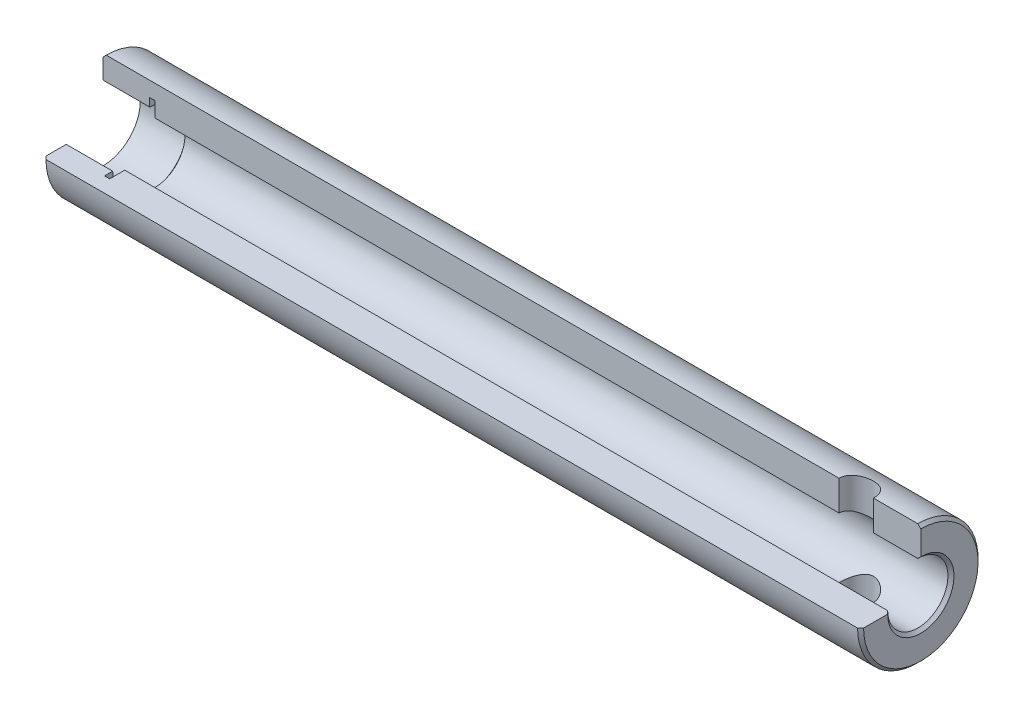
ISO-10303-21;
HEADER;
FILE_DESCRIPTION(('STEP AP214'),'2;1');
FILE_NAME('part.step','',(''),(''),'','','');
FILE_SCHEMA(('AUTOMOTIVE_DESIGN { 1 0 10303 214 1 1 1 1 }'));
ENDSEC;
DATA;
#1=APPLICATION_CONTEXT('core data for automotive mechanical design processes');
#2=APPLICATION_PROTOCOL_DEFINITION('international standard','automotive_design',2000,#1);
#3=PRODUCT_CONTEXT('',#1,'mechanical');
#4=PRODUCT('Part','Part','',(#3));
#5=PRODUCT_RELATED_PRODUCT_CATEGORY('part','',(#4));
#6=PRODUCT_DEFINITION_FORMATION('','',#4);
#7=PRODUCT_DEFINITION_CONTEXT('part definition',#1,'design');
#8=PRODUCT_DEFINITION('design','',#6,#7);
#9=PRODUCT_DEFINITION_SHAPE('','',#8);
#10=(LENGTH_UNIT() NAMED_UNIT(*) SI_UNIT(.MILLI.,.METRE.));
#11=(NAMED_UNIT(*) PLANE_ANGLE_UNIT() SI_UNIT($,.RADIAN.));
#12=(NAMED_UNIT(*) SI_UNIT($,.STERADIAN.) SOLID_ANGLE_UNIT());
#13=UNCERTAINTY_MEASURE_WITH_UNIT(LENGTH_MEASURE(1.E-05),#10,'distance_accuracy_value','');
#14=(GEOMETRIC_REPRESENTATION_CONTEXT(3) GLOBAL_UNCERTAINTY_ASSIGNED_CONTEXT((#13)) GLOBAL_UNIT_ASSIGNED_CONTEXT((#10,
#11,#12)) REPRESENTATION_CONTEXT('',''));
#15=CARTESIAN_POINT('',(0.,0.,0.));
#16=DIRECTION('',(0.,0.,1.));
#17=DIRECTION('',(1.,0.,0.));
#18=AXIS2_PLACEMENT_3D('',#15,#16,#17);
#19=CARTESIAN_POINT('',(95.,0.,0.));
#20=DIRECTION('',(-1.,0.,0.));
#21=DIRECTION('',(0.,0.,1.));
#22=AXIS2_PLACEMENT_3D('',#19,#20,#21);
#23=CYLINDRICAL_SURFACE('',#22,3.5);
#24=CARTESIAN_POINT('',(87.5,-2.87228132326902,2.));
#25=CARTESIAN_POINT('',(87.3982407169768,-2.87228454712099,1.99999795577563));
#26=CARTESIAN_POINT('',(87.296466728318,-2.87777067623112,1.99218519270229));
#27=CARTESIAN_POINT('',(87.0962654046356,-2.89880046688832,1.96144931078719));
#28=CARTESIAN_POINT('',(86.9978417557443,-2.91435485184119,1.938510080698));
#29=CARTESIAN_POINT('',(86.8076214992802,-2.95309076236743,1.87896057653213));
#30=CARTESIAN_POINT('',(86.7157863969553,-2.97622267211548,1.84243903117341));
#31=CARTESIAN_POINT('',(86.5395840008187,-3.02742059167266,1.75704253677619));
#32=CARTESIAN_POINT('',(86.4552191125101,-3.05548818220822,1.7081636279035));
#33=CARTESIAN_POINT('',(86.2861806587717,-3.11712928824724,1.59317521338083));
#34=CARTESIAN_POINT('',(86.2024899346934,-3.15096898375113,1.5257632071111));
#35=CARTESIAN_POINT('',(86.0468020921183,-3.21820634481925,1.37830388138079));
#36=CARTESIAN_POINT('',(85.9748125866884,-3.25160370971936,1.2982484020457));
#37=CARTESIAN_POINT('',(85.8378329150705,-3.31796239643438,1.11854160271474));
#38=CARTESIAN_POINT('',(85.7741545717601,-3.35058180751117,1.01775177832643));
#39=CARTESIAN_POINT('',(85.6651191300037,-3.40802542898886,0.804671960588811));
#40=CARTESIAN_POINT('',(85.619746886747,-3.43285607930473,0.692391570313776));
#41=CARTESIAN_POINT('',(85.5528618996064,-3.46996336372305,0.470016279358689));
#42=CARTESIAN_POINT('',(85.5295943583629,-3.48315582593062,0.360605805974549));
#43=CARTESIAN_POINT('',(85.5016929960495,-3.49901289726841,0.138713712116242));
#44=CARTESIAN_POINT('',(85.4970437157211,-3.50168624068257,0.0262347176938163));
#45=CARTESIAN_POINT('',(85.50608689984,-3.49652510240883,-0.18494696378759));
#46=CARTESIAN_POINT('',(85.5177697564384,-3.48984178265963,-0.283772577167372));
#47=CARTESIAN_POINT('',(85.5553945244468,-3.4686091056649,-0.477779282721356));
#48=CARTESIAN_POINT('',(85.5813374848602,-3.45405916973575,-0.572960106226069));
#49=CARTESIAN_POINT('',(85.6466509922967,-3.41820908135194,-0.758178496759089));
#50=CARTESIAN_POINT('',(85.6861387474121,-3.39685012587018,-0.848162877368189));
#51=CARTESIAN_POINT('',(85.7771178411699,-3.34915268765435,-1.02037827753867));
#52=CARTESIAN_POINT('',(85.8286127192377,-3.3228127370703,-1.10260700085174));
#53=CARTESIAN_POINT('',(85.9487459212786,-3.26394555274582,-1.26692918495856));
#54=CARTESIAN_POINT('',(86.0186641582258,-3.23105548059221,-1.34795656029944));
#55=CARTESIAN_POINT('',(86.1703346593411,-3.16439037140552,-1.49778980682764));
#56=CARTESIAN_POINT('',(86.2521012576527,-3.1306143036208,-1.56658064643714));
#57=CARTESIAN_POINT('',(86.4348802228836,-3.06212243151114,-1.69686219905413));
#58=CARTESIAN_POINT('',(86.5369984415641,-3.02764831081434,-1.75694261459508));
#59=CARTESIAN_POINT('',(86.7520775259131,-2.96628701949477,-1.85868169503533));
#60=CARTESIAN_POINT('',(86.8650187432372,-2.93938643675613,-1.90037300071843));
#61=CARTESIAN_POINT('',(87.0719095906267,-2.90265362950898,-1.955874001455));
#62=CARTESIAN_POINT('',(87.1642913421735,-2.89032428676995,-1.97388069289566));
#63=CARTESIAN_POINT('',(87.3513881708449,-2.87461858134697,-1.99669026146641));
#64=CARTESIAN_POINT('',(87.4461009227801,-2.87123363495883,-2.00150579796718));
#65=CARTESIAN_POINT('',(87.6351634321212,-2.87390377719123,-1.99766863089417));
#66=CARTESIAN_POINT('',(87.7295129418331,-2.87996444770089,-1.98900796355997));
#67=CARTESIAN_POINT('',(87.9151495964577,-2.90065746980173,-1.95870152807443));
#68=CARTESIAN_POINT('',(88.0064344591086,-2.91529606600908,-1.93704629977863));
#69=CARTESIAN_POINT('',(88.1849532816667,-2.95150911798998,-1.88140846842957));
#70=CARTESIAN_POINT('',(88.2721221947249,-2.97316813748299,-1.84727488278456));
#71=CARTESIAN_POINT('',(88.4398419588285,-3.02106419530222,-1.76785702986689));
#72=CARTESIAN_POINT('',(88.5203900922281,-3.04730309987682,-1.72256821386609));
#73=CARTESIAN_POINT('',(88.6867473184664,-3.10666399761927,-1.61341400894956));
#74=CARTESIAN_POINT('',(88.77120471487,-3.14020508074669,-1.54771199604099));
#75=CARTESIAN_POINT('',(88.9286857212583,-3.20718874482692,-1.40365915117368));
#76=CARTESIAN_POINT('',(89.0016997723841,-3.2406312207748,-1.32529785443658));
#77=CARTESIAN_POINT('',(89.1414787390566,-3.30761562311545,-1.14867494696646));
#78=CARTESIAN_POINT('',(89.2068912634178,-3.34083391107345,-1.04920745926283));
#79=CARTESIAN_POINT('',(89.3196584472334,-3.39983021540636,-0.838502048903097));
#80=CARTESIAN_POINT('',(89.3670273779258,-3.42561410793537,-0.727273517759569));
#81=CARTESIAN_POINT('',(89.4382164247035,-3.46494999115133,-0.505697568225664));
#82=CARTESIAN_POINT('',(89.4636402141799,-3.47932715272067,-0.396016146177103));
#83=CARTESIAN_POINT('',(89.4956646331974,-3.49749840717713,-0.173110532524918));
#84=CARTESIAN_POINT('',(89.5022819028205,-3.50130185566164,-0.0598895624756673));
#85=CARTESIAN_POINT('',(89.496662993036,-3.49809507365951,0.152663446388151));
#86=CARTESIAN_POINT('',(89.4865316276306,-3.49229198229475,0.252078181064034));
#87=CARTESIAN_POINT('',(89.4518141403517,-3.47266080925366,0.44751642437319));
#88=CARTESIAN_POINT('',(89.427227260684,-3.45883230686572,0.543539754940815));
#89=CARTESIAN_POINT('',(89.3646387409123,-3.42435356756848,0.729940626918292));
#90=CARTESIAN_POINT('',(89.3266150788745,-3.40369213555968,0.820308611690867));
#91=CARTESIAN_POINT('',(89.2385086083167,-3.35723286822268,0.993497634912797));
#92=CARTESIAN_POINT('',(89.1884224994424,-3.33143362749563,1.07631659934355));
#93=CARTESIAN_POINT('',(89.0713852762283,-3.27358852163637,1.24182171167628));
#94=CARTESIAN_POINT('',(89.0031857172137,-3.24116776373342,1.32349322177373));
#95=CARTESIAN_POINT('',(88.8549693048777,-3.17514349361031,1.4748902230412));
#96=CARTESIAN_POINT('',(88.7749383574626,-3.14153860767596,1.54460124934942));
#97=CARTESIAN_POINT('',(88.5953869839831,-3.07282960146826,1.67746044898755));
#98=CARTESIAN_POINT('',(88.4947035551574,-3.03793640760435,1.73915916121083));
#99=CARTESIAN_POINT('',(88.2823081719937,-2.97519675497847,1.84444649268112));
#100=CARTESIAN_POINT('',(88.1706146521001,-2.94733878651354,1.88806476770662));
#101=CARTESIAN_POINT('',(87.9657257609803,-2.90847763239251,1.9472313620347));
#102=CARTESIAN_POINT('',(87.8741836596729,-2.89507162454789,1.9669281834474));
#103=CARTESIAN_POINT('',(87.6884301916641,-2.87697604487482,1.99330737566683));
#104=CARTESIAN_POINT('',(87.5942213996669,-2.87227833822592,2.00000189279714));
#105=CARTESIAN_POINT('',(87.5,-2.87228132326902,2.));
#106=B_SPLINE_CURVE_WITH_KNOTS('',3,(#24,#25,#26,#27,#28,#29,#30,#31,#32,#33,#34,#35,#36,#37,
#38,#39,#40,#41,#42,#43,#44,#45,#46,#47,#48,#49,#50,#51,#52,#53,#54,#55,#56,#57,#58,#59,#60,#61,
#62,#63,#64,#65,#66,#67,#68,#69,#70,#71,#72,#73,#74,#75,#76,#77,#78,#79,#80,#81,#82,#83,#84,#85,
#86,#87,#88,#89,#90,#91,#92,#93,#94,#95,#96,#97,#98,#99,#100,#101,#102,#103,#104,#105),
.UNSPECIFIED.,.T.,.F.,(4,2,2,2,2,2,2,2,2,2,2,2,2,2,2,2,2,2,2,2,2,2,2,2,2,2,2,2,2,2,2,2,2,2,2,2,
2,2,2,2,4),(0.,0.304883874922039,0.610093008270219,0.913342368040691,1.21668902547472,
1.55333694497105,1.89020302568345,2.25902542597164,2.62754206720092,2.96347760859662,
3.29913415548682,3.59693222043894,3.89475219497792,4.19521719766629,4.49577088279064,
4.83030033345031,5.16523793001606,5.533547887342,5.90120143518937,6.18472748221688,
6.46798133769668,6.75140264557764,7.03503053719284,7.32221037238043,7.60950750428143,
7.944568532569,8.27990796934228,8.64873850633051,9.01727671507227,9.35580044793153,
9.69402456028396,9.99288076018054,10.291752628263,10.591116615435,10.8905626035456,
11.222913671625,11.5556638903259,11.9232239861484,12.2901787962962,12.572742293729,
12.8550417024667),.UNSPECIFIED.);
#107=CARTESIAN_POINT('',(87.5,-2.87228132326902,2.));
#108=VERTEX_POINT('',#107);
#109=EDGE_CURVE('E164',#108,#108,#106,.T.);
#110=ORIENTED_EDGE('',*,*,#109,.T.);
#111=EDGE_LOOP('',(#110));
#112=FACE_BOUND('',#111,.T.);
#113=CARTESIAN_POINT('',(94.65,0.,0.));
#114=DIRECTION('',(1.,0.,0.));
#115=DIRECTION('',(0.,0.,-1.));
#116=AXIS2_PLACEMENT_3D('',#113,#114,#115);
#117=CIRCLE('',#116,3.5);
#118=CARTESIAN_POINT('',(94.65,0.,3.5));
#119=VERTEX_POINT('',#118);
#120=CARTESIAN_POINT('',(94.65,3.5,0.));
#121=VERTEX_POINT('',#120);
#122=EDGE_CURVE('E297',#119,#121,#117,.T.);
#123=ORIENTED_EDGE('',*,*,#122,.T.);
#124=DIRECTION('',(-1.,0.,0.));
#125=VECTOR('',#124,1.);
#126=CARTESIAN_POINT('',(95.,3.5,0.));
#127=LINE('',#126,#125);
#128=CARTESIAN_POINT('',(89.5,3.5,0.));
#129=VERTEX_POINT('',#128);
#130=EDGE_CURVE('E250',#129,#121,#127,.F.);
#131=ORIENTED_EDGE('',*,*,#130,.F.);
#132=CARTESIAN_POINT('',(87.5,2.87228132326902,-2.));
#133=CARTESIAN_POINT('',(87.6017592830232,2.87228454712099,-1.99999795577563));
#134=CARTESIAN_POINT('',(87.703533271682,2.87777067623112,-1.99218519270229));
#135=CARTESIAN_POINT('',(87.9037345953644,2.89880046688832,-1.96144931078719));
#136=CARTESIAN_POINT('',(88.0021582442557,2.91435485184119,-1.938510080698));
#137=CARTESIAN_POINT('',(88.1923785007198,2.95309076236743,-1.87896057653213));
#138=CARTESIAN_POINT('',(88.2842136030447,2.97622267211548,-1.84243903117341));
#139=CARTESIAN_POINT('',(88.4604159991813,3.02742059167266,-1.75704253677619));
#140=CARTESIAN_POINT('',(88.5447808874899,3.05548818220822,-1.7081636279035));
#141=CARTESIAN_POINT('',(88.7138193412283,3.11712928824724,-1.59317521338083));
#142=CARTESIAN_POINT('',(88.7975100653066,3.15096898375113,-1.5257632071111));
#143=CARTESIAN_POINT('',(88.9531979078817,3.21820634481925,-1.37830388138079));
#144=CARTESIAN_POINT('',(89.0251874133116,3.25160370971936,-1.2982484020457));
#145=CARTESIAN_POINT('',(89.1621670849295,3.31796239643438,-1.11854160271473));
#146=CARTESIAN_POINT('',(89.2258454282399,3.35058180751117,-1.01775177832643));
#147=CARTESIAN_POINT('',(89.3348808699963,3.40802542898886,-0.804671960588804));
#148=CARTESIAN_POINT('',(89.380253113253,3.43285607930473,-0.692391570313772));
#149=CARTESIAN_POINT('',(89.4471381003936,3.46996336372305,-0.470016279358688));
#150=CARTESIAN_POINT('',(89.4704056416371,3.48315582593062,-0.360605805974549));
#151=CARTESIAN_POINT('',(89.4983070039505,3.49901289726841,-0.138713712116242));
#152=CARTESIAN_POINT('',(89.5029562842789,3.50168624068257,-0.0262347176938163));
#153=CARTESIAN_POINT('',(89.49391310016,3.49652510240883,0.18494696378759));
#154=CARTESIAN_POINT('',(89.4822302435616,3.48984178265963,0.283772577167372));
#155=CARTESIAN_POINT('',(89.4446054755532,3.4686091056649,0.477779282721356));
#156=CARTESIAN_POINT('',(89.4186625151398,3.45405916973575,0.572960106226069));
#157=CARTESIAN_POINT('',(89.3533490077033,3.41820908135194,0.758178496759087));
#158=CARTESIAN_POINT('',(89.3138612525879,3.39685012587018,0.848162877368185));
#159=CARTESIAN_POINT('',(89.22288215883,3.34915268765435,1.02037827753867));
#160=CARTESIAN_POINT('',(89.1713872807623,3.3228127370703,1.10260700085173));
#161=CARTESIAN_POINT('',(89.0512540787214,3.26394555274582,1.26692918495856));
#162=CARTESIAN_POINT('',(88.9813358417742,3.23105548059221,1.34795656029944));
#163=CARTESIAN_POINT('',(88.8296653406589,3.16439037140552,1.49778980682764));
#164=CARTESIAN_POINT('',(88.7478987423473,3.1306143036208,1.56658064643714));
#165=CARTESIAN_POINT('',(88.5651197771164,3.06212243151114,1.69686219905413));
#166=CARTESIAN_POINT('',(88.4630015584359,3.02764831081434,1.75694261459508));
#167=CARTESIAN_POINT('',(88.2479224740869,2.96628701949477,1.85868169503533));
#168=CARTESIAN_POINT('',(88.1349812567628,2.93938643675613,1.90037300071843));
#169=CARTESIAN_POINT('',(87.9280904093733,2.90265362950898,1.955874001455));
#170=CARTESIAN_POINT('',(87.8357086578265,2.89032428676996,1.97388069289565));
#171=CARTESIAN_POINT('',(87.6486118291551,2.87461858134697,1.99669026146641));
#172=CARTESIAN_POINT('',(87.5538990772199,2.87123363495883,2.00150579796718));
#173=CARTESIAN_POINT('',(87.3648365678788,2.87390377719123,1.99766863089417));
#174=CARTESIAN_POINT('',(87.2704870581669,2.87996444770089,1.98900796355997));
#175=CARTESIAN_POINT('',(87.0848504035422,2.90065746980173,1.95870152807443));
#176=CARTESIAN_POINT('',(86.9935655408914,2.91529606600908,1.93704629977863));
#177=CARTESIAN_POINT('',(86.8150467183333,2.95150911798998,1.88140846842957));
#178=CARTESIAN_POINT('',(86.7278778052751,2.97316813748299,1.84727488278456));
#179=CARTESIAN_POINT('',(86.5601580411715,3.02106419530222,1.76785702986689));
#180=CARTESIAN_POINT('',(86.4796099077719,3.04730309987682,1.72256821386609));
#181=CARTESIAN_POINT('',(86.3132526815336,3.10666399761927,1.61341400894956));
#182=CARTESIAN_POINT('',(86.22879528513,3.14020508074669,1.54771199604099));
#183=CARTESIAN_POINT('',(86.0713142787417,3.20718874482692,1.40365915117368));
#184=CARTESIAN_POINT('',(85.9983002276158,3.2406312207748,1.32529785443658));
#185=CARTESIAN_POINT('',(85.8585212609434,3.30761562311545,1.14867494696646));
#186=CARTESIAN_POINT('',(85.7931087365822,3.34083391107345,1.04920745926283));
#187=CARTESIAN_POINT('',(85.6803415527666,3.39983021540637,0.838502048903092));
#188=CARTESIAN_POINT('',(85.6329726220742,3.42561410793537,0.727273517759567));
#189=CARTESIAN_POINT('',(85.5617835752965,3.46494999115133,0.505697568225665));
#190=CARTESIAN_POINT('',(85.5363597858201,3.47932715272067,0.396016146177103));
#191=CARTESIAN_POINT('',(85.5043353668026,3.49749840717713,0.173110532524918));
#192=CARTESIAN_POINT('',(85.4977180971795,3.50130185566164,0.0598895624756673));
#193=CARTESIAN_POINT('',(85.503337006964,3.49809507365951,-0.152663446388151));
#194=CARTESIAN_POINT('',(85.5134683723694,3.49229198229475,-0.252078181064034));
#195=CARTESIAN_POINT('',(85.5481858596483,3.47266080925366,-0.44751642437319));
#196=CARTESIAN_POINT('',(85.572772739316,3.45883230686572,-0.543539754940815));
#197=CARTESIAN_POINT('',(85.6353612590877,3.42435356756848,-0.729940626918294));
#198=CARTESIAN_POINT('',(85.6733849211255,3.40369213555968,-0.820308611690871));
#199=CARTESIAN_POINT('',(85.7614913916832,3.35723286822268,-0.993497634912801));
#200=CARTESIAN_POINT('',(85.8115775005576,3.33143362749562,-1.07631659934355));
#201=CARTESIAN_POINT('',(85.9286147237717,3.27358852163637,-1.24182171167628));
#202=CARTESIAN_POINT('',(85.9968142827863,3.24116776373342,-1.32349322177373));
#203=CARTESIAN_POINT('',(86.1450306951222,3.17514349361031,-1.4748902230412));
#204=CARTESIAN_POINT('',(86.2250616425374,3.14153860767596,-1.54460124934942));
#205=CARTESIAN_POINT('',(86.4046130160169,3.07282960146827,-1.67746044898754));
#206=CARTESIAN_POINT('',(86.5052964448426,3.03793640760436,-1.73915916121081));
#207=CARTESIAN_POINT('',(86.7176918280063,2.97519675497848,-1.84444649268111));
#208=CARTESIAN_POINT('',(86.8293853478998,2.94733878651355,-1.88806476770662));
#209=CARTESIAN_POINT('',(87.0342742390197,2.9084776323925,-1.9472313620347));
#210=CARTESIAN_POINT('',(87.1258163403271,2.89507162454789,-1.9669281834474));
#211=CARTESIAN_POINT('',(87.3115698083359,2.87697604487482,-1.99330737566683));
#212=CARTESIAN_POINT('',(87.4057786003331,2.87227833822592,-2.00000189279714));
#213=CARTESIAN_POINT('',(87.5,2.87228132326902,-2.));
#214=B_SPLINE_CURVE_WITH_KNOTS('',3,(#132,#133,#134,#135,#136,#137,#138,#139,#140,#141,#142,
#143,#144,#145,#146,#147,#148,#149,#150,#151,#152,#153,#154,#155,#156,#157,#158,#159,#160,#161,
#162,#163,#164,#165,#166,#167,#168,#169,#170,#171,#172,#173,#174,#175,#176,#177,#178,#179,#180,
#181,#182,#183,#184,#185,#186,#187,#188,#189,#190,#191,#192,#193,#194,#195,#196,#197,#198,#199,
#200,#201,#202,#203,#204,#205,#206,#207,#208,#209,#210,#211,#212,#213),.UNSPECIFIED.,.T.,.F.,(4,
2,2,2,2,2,2,2,2,2,2,2,2,2,2,2,2,2,2,2,2,2,2,2,2,2,2,2,2,2,2,2,2,2,2,2,2,2,2,2,4),(0.,
0.304883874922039,0.610093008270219,0.913342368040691,1.21668902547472,1.55333694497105,
1.89020302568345,2.25902542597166,2.62754206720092,2.96347760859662,3.29913415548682,
3.59693222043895,3.89475219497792,4.19521719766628,4.49577088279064,4.83030033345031,
5.16523793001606,5.533547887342,5.90120143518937,6.18472748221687,6.46798133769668,
6.75140264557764,7.03503053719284,7.32221037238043,7.60950750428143,7.944568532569,
8.27990796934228,8.64873850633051,9.01727671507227,9.35580044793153,9.69402456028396,
9.99288076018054,10.291752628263,10.591116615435,10.8905626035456,11.222913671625,
11.5556638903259,11.9232239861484,12.2901787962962,12.572742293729,12.8550417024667),.UNSPECIFIED.);
#215=CARTESIAN_POINT('',(85.5,3.5,0.));
#216=VERTEX_POINT('',#215);
#217=EDGE_CURVE('E285',#216,#129,#214,.T.);
#218=ORIENTED_EDGE('',*,*,#217,.F.);
#219=CARTESIAN_POINT('',(6.00000000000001,3.5,0.));
#220=VERTEX_POINT('',#219);
#221=EDGE_CURVE('E252',#220,#216,#127,.F.);
#222=ORIENTED_EDGE('',*,*,#221,.F.);
#223=CARTESIAN_POINT('',(6.00000000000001,0.,0.));
#224=DIRECTION('',(-1.,0.,0.));
#225=DIRECTION('',(0.,0.,1.));
#226=AXIS2_PLACEMENT_3D('',#223,#224,#225);
#227=CIRCLE('',#226,3.5);
#228=CARTESIAN_POINT('',(6.00000000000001,0.,3.5));
#229=VERTEX_POINT('',#228);
#230=EDGE_CURVE('E152',#220,#229,#227,.T.);
#231=ORIENTED_EDGE('',*,*,#230,.T.);
#232=DIRECTION('',(-1.,0.,0.));
#233=VECTOR('',#232,1.);
#234=CARTESIAN_POINT('',(95.,0.,3.5));
#235=LINE('',#234,#233);
#236=EDGE_CURVE('E274',#119,#229,#235,.T.);
#237=ORIENTED_EDGE('',*,*,#236,.F.);
#238=EDGE_LOOP('',(#123,#131,#218,#222,#231,#237));
#239=FACE_BOUND('',#238,.T.);
#240=ADVANCED_FACE('F33',(#112,#239),#23,.F.);
#241=CARTESIAN_POINT('',(95.,0.,0.));
#242=DIRECTION('',(-1.,0.,0.));
#243=DIRECTION('',(0.,0.,1.));
#244=AXIS2_PLACEMENT_3D('',#241,#242,#243);
#245=CYLINDRICAL_SURFACE('',#244,7.);
#246=CARTESIAN_POINT('',(87.5,-6.70820393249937,2.));
#247=CARTESIAN_POINT('',(87.3901484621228,-6.70820547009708,1.99999802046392));
#248=CARTESIAN_POINT('',(87.2802769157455,-6.71093179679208,1.9909186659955));
#249=CARTESIAN_POINT('',(87.063728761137,-6.72150389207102,1.95492363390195));
#250=CARTESIAN_POINT('',(86.9570534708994,-6.72935174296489,1.92800070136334));
#251=CARTESIAN_POINT('',(86.7500627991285,-6.74920709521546,1.85729343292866));
#252=CARTESIAN_POINT('',(86.6497378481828,-6.76120815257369,1.81353520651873));
#253=CARTESIAN_POINT('',(86.4578321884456,-6.78800921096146,1.71048364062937));
#254=CARTESIAN_POINT('',(86.366252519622,-6.80280954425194,1.65118845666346));
#255=CARTESIAN_POINT('',(86.1918084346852,-6.83401783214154,1.51692480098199));
#256=CARTESIAN_POINT('',(86.1092321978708,-6.8504575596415,1.4415892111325));
#257=CARTESIAN_POINT('',(85.9576972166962,-6.88281965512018,1.27817124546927));
#258=CARTESIAN_POINT('',(85.8887400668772,-6.89874196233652,1.19008737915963));
#259=CARTESIAN_POINT('',(85.7651713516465,-6.92863332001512,1.00164603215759));
#260=CARTESIAN_POINT('',(85.710850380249,-6.94256054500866,0.901090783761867));
#261=CARTESIAN_POINT('',(85.619998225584,-6.96652540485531,0.69180847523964));
#262=CARTESIAN_POINT('',(85.5834635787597,-6.97656379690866,0.583083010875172));
#263=CARTESIAN_POINT('',(85.5301655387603,-6.99139519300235,0.363558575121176));
#264=CARTESIAN_POINT('',(85.5129109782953,-6.99631827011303,0.252887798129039));
#265=CARTESIAN_POINT('',(85.4971132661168,-7.00082095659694,0.0301201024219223));
#266=CARTESIAN_POINT('',(85.4985665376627,-7.00040158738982,-0.0819765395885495));
#267=CARTESIAN_POINT('',(85.519806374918,-6.99436006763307,-0.300980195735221));
#268=CARTESIAN_POINT('',(85.539061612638,-6.98888870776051,-0.407943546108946));
#269=CARTESIAN_POINT('',(85.5944951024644,-6.97353886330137,-0.617052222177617));
#270=CARTESIAN_POINT('',(85.6306743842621,-6.96366011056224,-0.719197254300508));
#271=CARTESIAN_POINT('',(85.7193094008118,-6.9403903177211,-0.91707383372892));
#272=CARTESIAN_POINT('',(85.7719387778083,-6.92696205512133,-1.01272304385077));
#273=CARTESIAN_POINT('',(85.891844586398,-6.89802768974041,-1.19400724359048));
#274=CARTESIAN_POINT('',(85.9591242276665,-6.8825211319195,-1.279640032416));
#275=CARTESIAN_POINT('',(86.1092057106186,-6.85045683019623,-1.44163264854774));
#276=CARTESIAN_POINT('',(86.1924694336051,-6.83388129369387,-1.51756157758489));
#277=CARTESIAN_POINT('',(86.370715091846,-6.80202973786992,-1.65449301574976));
#278=CARTESIAN_POINT('',(86.465697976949,-6.78675382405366,-1.71549431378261));
#279=CARTESIAN_POINT('',(86.665730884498,-6.75915174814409,-1.82123335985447));
#280=CARTESIAN_POINT('',(86.7708552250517,-6.74685010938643,-1.86583737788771));
#281=CARTESIAN_POINT('',(86.9875531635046,-6.72688544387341,-1.9365895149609));
#282=CARTESIAN_POINT('',(87.0991248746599,-6.71922106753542,-1.96274300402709));
#283=CARTESIAN_POINT('',(87.3214804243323,-6.70969115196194,-1.99507417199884));
#284=CARTESIAN_POINT('',(87.432161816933,-6.70763711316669,-2.00190148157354));
#285=CARTESIAN_POINT('',(87.653088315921,-6.7090415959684,-1.99718996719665));
#286=CARTESIAN_POINT('',(87.7633334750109,-6.71249942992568,-1.98565343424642));
#287=CARTESIAN_POINT('',(87.9776412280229,-6.72435430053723,-1.94511781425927));
#288=CARTESIAN_POINT('',(88.0817875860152,-6.73263642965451,-1.9165246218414));
#289=CARTESIAN_POINT('',(88.2838018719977,-6.75309063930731,-1.84315161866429));
#290=CARTESIAN_POINT('',(88.3816688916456,-6.7652632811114,-1.79836947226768));
#291=CARTESIAN_POINT('',(88.5710220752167,-6.7925018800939,-1.69261965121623));
#292=CARTESIAN_POINT('',(88.6622904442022,-6.80763197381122,-1.63127891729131));
#293=CARTESIAN_POINT('',(88.8334763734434,-6.83893726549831,-1.49460463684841));
#294=CARTESIAN_POINT('',(88.9133914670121,-6.85511268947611,-1.41926805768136));
#295=CARTESIAN_POINT('',(89.0623794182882,-6.88734727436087,-1.25370800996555));
#296=CARTESIAN_POINT('',(89.1309949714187,-6.90338406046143,-1.16306771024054));
#297=CARTESIAN_POINT('',(89.2520456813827,-6.93297977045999,-0.971185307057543));
#298=CARTESIAN_POINT('',(89.3044816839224,-6.94653882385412,-0.869943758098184));
#299=CARTESIAN_POINT('',(89.3911842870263,-6.96956504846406,-0.660433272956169));
#300=CARTESIAN_POINT('',(89.4255883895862,-6.97906308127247,-0.552224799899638));
#301=CARTESIAN_POINT('',(89.4756268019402,-6.99303339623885,-0.331245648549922));
#302=CARTESIAN_POINT('',(89.4912659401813,-6.99750697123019,-0.218476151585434));
#303=CARTESIAN_POINT('',(89.5029914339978,-7.00085335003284,0.00417823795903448));
#304=CARTESIAN_POINT('',(89.4997441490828,-6.99991703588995,0.114025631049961));
#305=CARTESIAN_POINT('',(89.4753617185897,-6.99299069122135,0.331545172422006));
#306=CARTESIAN_POINT('',(89.454227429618,-6.98700090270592,0.439217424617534));
#307=CARTESIAN_POINT('',(89.3950686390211,-6.97068801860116,0.648404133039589));
#308=CARTESIAN_POINT('',(89.357196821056,-6.96040414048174,0.74996503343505));
#309=CARTESIAN_POINT('',(89.2657738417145,-6.93657094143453,0.945347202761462));
#310=CARTESIAN_POINT('',(89.2122202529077,-6.92302111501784,1.03916727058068));
#311=CARTESIAN_POINT('',(89.0891026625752,-6.89358955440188,1.21943345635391));
#312=CARTESIAN_POINT('',(89.0191099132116,-6.8776504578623,1.30557732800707));
#313=CARTESIAN_POINT('',(88.8658908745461,-6.84544064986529,1.46512122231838));
#314=CARTESIAN_POINT('',(88.7826609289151,-6.82916984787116,1.5385177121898));
#315=CARTESIAN_POINT('',(88.6027030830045,-6.79764037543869,1.67240846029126));
#316=CARTESIAN_POINT('',(88.5056780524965,-6.78241951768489,1.73251316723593));
#317=CARTESIAN_POINT('',(88.3024781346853,-6.7552844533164,1.83547943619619));
#318=CARTESIAN_POINT('',(88.1963084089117,-6.74336839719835,1.8783506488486));
#319=CARTESIAN_POINT('',(87.9923462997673,-6.72558459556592,1.94098534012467));
#320=CARTESIAN_POINT('',(87.8953096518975,-6.71912438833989,1.96305899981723));
#321=CARTESIAN_POINT('',(87.6988538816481,-6.71043369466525,1.99256607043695));
#322=CARTESIAN_POINT('',(87.5994351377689,-6.70820254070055,2.00000179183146));
#323=CARTESIAN_POINT('',(87.5,-6.70820393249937,2.));
#324=B_SPLINE_CURVE_WITH_KNOTS('',3,(#246,#247,#248,#249,#250,#251,#252,#253,#254,#255,#256,
#257,#258,#259,#260,#261,#262,#263,#264,#265,#266,#267,#268,#269,#270,#271,#272,#273,#274,#275,
#276,#277,#278,#279,#280,#281,#282,#283,#284,#285,#286,#287,#288,#289,#290,#291,#292,#293,#294,
#295,#296,#297,#298,#299,#300,#301,#302,#303,#304,#305,#306,#307,#308,#309,#310,#311,#312,#313,
#314,#315,#316,#317,#318,#319,#320,#321,#322,#323),.UNSPECIFIED.,.T.,.F.,(4,2,2,2,2,2,2,2,2,2,2,
2,2,2,2,2,2,2,2,2,2,2,2,2,2,2,2,2,2,2,2,2,2,2,2,2,2,2,4),(0.,0.329188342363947,
0.658510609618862,0.987324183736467,1.31617681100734,1.65357167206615,1.99100601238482,
2.33471483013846,2.67835669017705,3.01302901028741,3.34763734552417,3.67257037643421,
3.99752317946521,4.3260290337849,4.65460693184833,4.99471612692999,5.33485290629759,
5.67770520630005,6.02045767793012,6.3515436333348,6.68258828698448,7.00605289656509,
7.32956419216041,7.6610800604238,7.99266784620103,8.33545388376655,8.67822200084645,
9.01833685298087,9.35836417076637,9.68646897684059,10.0145580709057,10.3397141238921,
10.6649205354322,10.9997976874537,11.3347674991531,11.6785361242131,12.0221119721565,
12.3201328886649,12.61810676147),.UNSPECIFIED.);
#325=CARTESIAN_POINT('',(87.5,-6.70820393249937,2.));
#326=VERTEX_POINT('',#325);
#327=EDGE_CURVE('E171',#326,#326,#324,.T.);
#328=ORIENTED_EDGE('',*,*,#327,.F.);
#329=EDGE_LOOP('',(#328));
#330=FACE_BOUND('',#329,.T.);
#331=DIRECTION('',(-1.,0.,0.));
#332=VECTOR('',#331,1.);
#333=CARTESIAN_POINT('',(95.001,7.,0.));
#334=LINE('',#333,#332);
#335=CARTESIAN_POINT('',(94.65,7.,0.));
#336=VERTEX_POINT('',#335);
#337=CARTESIAN_POINT('',(89.5,7.,0.));
#338=VERTEX_POINT('',#337);
#339=EDGE_CURVE('E50',#336,#338,#334,.T.);
#340=ORIENTED_EDGE('',*,*,#339,.F.);
#341=CARTESIAN_POINT('',(94.65,0.,0.));
#342=DIRECTION('',(1.,0.,0.));
#343=DIRECTION('',(0.,0.,-1.));
#344=AXIS2_PLACEMENT_3D('',#341,#342,#343);
#345=CIRCLE('',#344,7.);
#346=CARTESIAN_POINT('',(94.65,0.,6.99999999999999));
#347=VERTEX_POINT('',#346);
#348=EDGE_CURVE('E279',#336,#347,#345,.F.);
#349=ORIENTED_EDGE('',*,*,#348,.T.);
#350=DIRECTION('',(-1.,0.,0.));
#351=VECTOR('',#350,1.);
#352=CARTESIAN_POINT('',(95.001,0.,7.));
#353=LINE('',#352,#351);
#354=CARTESIAN_POINT('',(0.349999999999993,0.,7.));
#355=VERTEX_POINT('',#354);
#356=EDGE_CURVE('E267',#347,#355,#353,.T.);
#357=ORIENTED_EDGE('',*,*,#356,.T.);
#358=CARTESIAN_POINT('',(0.350000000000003,0.,0.));
#359=DIRECTION('',(1.,0.,0.));
#360=DIRECTION('',(0.,0.,-1.));
#361=AXIS2_PLACEMENT_3D('',#358,#359,#360);
#362=CIRCLE('',#361,7.);
#363=CARTESIAN_POINT('',(0.350000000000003,7.,0.));
#364=VERTEX_POINT('',#363);
#365=EDGE_CURVE('E284',#355,#364,#362,.T.);
#366=ORIENTED_EDGE('',*,*,#365,.T.);
#367=CARTESIAN_POINT('',(85.5,7.,0.));
#368=VERTEX_POINT('',#367);
#369=EDGE_CURVE('E270',#368,#364,#334,.T.);
#370=ORIENTED_EDGE('',*,*,#369,.F.);
#371=CARTESIAN_POINT('',(87.5,6.70820393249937,-2.));
#372=CARTESIAN_POINT('',(87.6098515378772,6.70820547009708,-1.99999802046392));
#373=CARTESIAN_POINT('',(87.7197230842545,6.71093179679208,-1.9909186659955));
#374=CARTESIAN_POINT('',(87.936271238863,6.72150389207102,-1.95492363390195));
#375=CARTESIAN_POINT('',(88.0429465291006,6.72935174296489,-1.92800070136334));
#376=CARTESIAN_POINT('',(88.2499372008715,6.74920709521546,-1.85729343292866));
#377=CARTESIAN_POINT('',(88.3502621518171,6.76120815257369,-1.81353520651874));
#378=CARTESIAN_POINT('',(88.5421678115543,6.78800921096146,-1.71048364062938));
#379=CARTESIAN_POINT('',(88.633747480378,6.80280954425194,-1.65118845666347));
#380=CARTESIAN_POINT('',(88.8081915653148,6.83401783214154,-1.51692480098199));
#381=CARTESIAN_POINT('',(88.8907678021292,6.8504575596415,-1.4415892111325));
#382=CARTESIAN_POINT('',(89.0423027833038,6.88281965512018,-1.27817124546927));
#383=CARTESIAN_POINT('',(89.1112599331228,6.89874196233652,-1.19008737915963));
#384=CARTESIAN_POINT('',(89.2348286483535,6.92863332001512,-1.00164603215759));
#385=CARTESIAN_POINT('',(89.289149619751,6.94256054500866,-0.901090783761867));
#386=CARTESIAN_POINT('',(89.380001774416,6.96652540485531,-0.69180847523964));
#387=CARTESIAN_POINT('',(89.4165364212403,6.97656379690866,-0.583083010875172));
#388=CARTESIAN_POINT('',(89.4698344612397,6.99139519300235,-0.363558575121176));
#389=CARTESIAN_POINT('',(89.4870890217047,6.99631827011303,-0.252887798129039));
#390=CARTESIAN_POINT('',(89.5028867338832,7.00082095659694,-0.0301201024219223));
#391=CARTESIAN_POINT('',(89.5014334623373,7.00040158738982,0.0819765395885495));
#392=CARTESIAN_POINT('',(89.480193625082,6.99436006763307,0.300980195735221));
#393=CARTESIAN_POINT('',(89.460938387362,6.98888870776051,0.407943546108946));
#394=CARTESIAN_POINT('',(89.4055048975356,6.97353886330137,0.617052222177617));
#395=CARTESIAN_POINT('',(89.3693256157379,6.96366011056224,0.719197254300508));
#396=CARTESIAN_POINT('',(89.2806905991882,6.9403903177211,0.917073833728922));
#397=CARTESIAN_POINT('',(89.2280612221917,6.92696205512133,1.01272304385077));
#398=CARTESIAN_POINT('',(89.108155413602,6.89802768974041,1.19400724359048));
#399=CARTESIAN_POINT('',(89.0408757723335,6.8825211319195,1.279640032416));
#400=CARTESIAN_POINT('',(88.8907942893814,6.85045683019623,1.44163264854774));
#401=CARTESIAN_POINT('',(88.8075305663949,6.83388129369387,1.51756157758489));
#402=CARTESIAN_POINT('',(88.629284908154,6.80202973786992,1.65449301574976));
#403=CARTESIAN_POINT('',(88.534302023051,6.78675382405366,1.71549431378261));
#404=CARTESIAN_POINT('',(88.334269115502,6.75915174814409,1.82123335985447));
#405=CARTESIAN_POINT('',(88.2291447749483,6.74685010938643,1.86583737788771));
#406=CARTESIAN_POINT('',(88.0124468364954,6.72688544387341,1.9365895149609));
#407=CARTESIAN_POINT('',(87.9008751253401,6.71922106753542,1.96274300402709));
#408=CARTESIAN_POINT('',(87.6785195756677,6.70969115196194,1.99507417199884));
#409=CARTESIAN_POINT('',(87.567838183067,6.70763711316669,2.00190148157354));
#410=CARTESIAN_POINT('',(87.346911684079,6.7090415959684,1.99718996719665));
#411=CARTESIAN_POINT('',(87.2366665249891,6.71249942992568,1.98565343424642));
#412=CARTESIAN_POINT('',(87.022358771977,6.72435430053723,1.94511781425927));
#413=CARTESIAN_POINT('',(86.9182124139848,6.73263642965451,1.91652462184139));
#414=CARTESIAN_POINT('',(86.7161981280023,6.75309063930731,1.84315161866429));
#415=CARTESIAN_POINT('',(86.6183311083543,6.7652632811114,1.79836947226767));
#416=CARTESIAN_POINT('',(86.4289779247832,6.7925018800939,1.69261965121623));
#417=CARTESIAN_POINT('',(86.3377095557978,6.80763197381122,1.63127891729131));
#418=CARTESIAN_POINT('',(86.1665236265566,6.83893726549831,1.49460463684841));
#419=CARTESIAN_POINT('',(86.0866085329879,6.85511268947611,1.41926805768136));
#420=CARTESIAN_POINT('',(85.9376205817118,6.88734727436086,1.25370800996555));
#421=CARTESIAN_POINT('',(85.8690050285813,6.90338406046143,1.16306771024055));
#422=CARTESIAN_POINT('',(85.7479543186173,6.93297977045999,0.971185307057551));
#423=CARTESIAN_POINT('',(85.6955183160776,6.94653882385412,0.869943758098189));
#424=CARTESIAN_POINT('',(85.6088157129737,6.96956504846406,0.66043327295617));
#425=CARTESIAN_POINT('',(85.5744116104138,6.97906308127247,0.552224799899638));
#426=CARTESIAN_POINT('',(85.5243731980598,6.99303339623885,0.331245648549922));
#427=CARTESIAN_POINT('',(85.5087340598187,6.99750697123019,0.218476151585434));
#428=CARTESIAN_POINT('',(85.4970085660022,7.00085335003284,-0.00417823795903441));
#429=CARTESIAN_POINT('',(85.5002558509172,6.99991703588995,-0.114025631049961));
#430=CARTESIAN_POINT('',(85.5246382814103,6.99299069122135,-0.331545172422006));
#431=CARTESIAN_POINT('',(85.545772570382,6.98700090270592,-0.439217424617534));
#432=CARTESIAN_POINT('',(85.6049313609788,6.97068801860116,-0.648404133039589));
#433=CARTESIAN_POINT('',(85.642803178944,6.96040414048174,-0.74996503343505));
#434=CARTESIAN_POINT('',(85.7342261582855,6.93657094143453,-0.945347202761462));
#435=CARTESIAN_POINT('',(85.7877797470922,6.92302111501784,-1.03916727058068));
#436=CARTESIAN_POINT('',(85.9108973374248,6.89358955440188,-1.21943345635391));
#437=CARTESIAN_POINT('',(85.9808900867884,6.87765045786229,-1.30557732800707));
#438=CARTESIAN_POINT('',(86.1341091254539,6.84544064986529,-1.46512122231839));
#439=CARTESIAN_POINT('',(86.2173390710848,6.82916984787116,-1.53851771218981));
#440=CARTESIAN_POINT('',(86.3972969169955,6.79764037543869,-1.67240846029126));
#441=CARTESIAN_POINT('',(86.4943219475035,6.78241951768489,-1.73251316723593));
#442=CARTESIAN_POINT('',(86.6975218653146,6.7552844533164,-1.83547943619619));
#443=CARTESIAN_POINT('',(86.8036915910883,6.74336839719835,-1.8783506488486));
#444=CARTESIAN_POINT('',(87.0076537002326,6.72558459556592,-1.94098534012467));
#445=CARTESIAN_POINT('',(87.1046903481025,6.71912438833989,-1.96305899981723));
#446=CARTESIAN_POINT('',(87.3011461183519,6.71043369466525,-1.99256607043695));
#447=CARTESIAN_POINT('',(87.4005648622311,6.70820254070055,-2.00000179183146));
#448=CARTESIAN_POINT('',(87.5,6.70820393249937,-2.));
#449=B_SPLINE_CURVE_WITH_KNOTS('',3,(#371,#372,#373,#374,#375,#376,#377,#378,#379,#380,#381,
#382,#383,#384,#385,#386,#387,#388,#389,#390,#391,#392,#393,#394,#395,#396,#397,#398,#399,#400,
#401,#402,#403,#404,#405,#406,#407,#408,#409,#410,#411,#412,#413,#414,#415,#416,#417,#418,#419,
#420,#421,#422,#423,#424,#425,#426,#427,#428,#429,#430,#431,#432,#433,#434,#435,#436,#437,#438,
#439,#440,#441,#442,#443,#444,#445,#446,#447,#448),.UNSPECIFIED.,.T.,.F.,(4,2,2,2,2,2,2,2,2,2,2,
2,2,2,2,2,2,2,2,2,2,2,2,2,2,2,2,2,2,2,2,2,2,2,2,2,2,2,4),(0.,0.329188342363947,
0.658510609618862,0.987324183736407,1.31617681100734,1.65357167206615,1.99100601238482,
2.33471483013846,2.67835669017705,3.01302901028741,3.34763734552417,3.67257037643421,
3.99752317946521,4.3260290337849,4.65460693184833,4.99471612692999,5.33485290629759,
5.67770520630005,6.02045767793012,6.3515436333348,6.68258828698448,7.00605289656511,
7.32956419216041,7.6610800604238,7.99266784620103,8.33545388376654,8.67822200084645,
9.01833685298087,9.35836417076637,9.68646897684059,10.0145580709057,10.3397141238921,
10.6649205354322,10.9997976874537,11.3347674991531,11.6785361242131,12.0221119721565,
12.3201328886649,12.61810676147),.UNSPECIFIED.);
#450=EDGE_CURVE('E290',#368,#338,#449,.T.);
#451=ORIENTED_EDGE('',*,*,#450,.T.);
#452=EDGE_LOOP('',(#340,#349,#357,#366,#370,#451));
#453=FACE_BOUND('',#452,.T.);
#454=ADVANCED_FACE('F205',(#330,#453),#245,.T.);
#455=CARTESIAN_POINT('',(95.,0.,0.));
#456=DIRECTION('',(1.,0.,0.));
#457=DIRECTION('',(0.,0.,-1.));
#458=AXIS2_PLACEMENT_3D('',#455,#456,#457);
#459=PLANE('',#458);
#460=CARTESIAN_POINT('',(95.,0.,0.));
#461=DIRECTION('',(1.,0.,0.));
#462=DIRECTION('',(0.,0.,-1.));
#463=AXIS2_PLACEMENT_3D('',#460,#461,#462);
#464=CIRCLE('',#463,6.65);
#465=CARTESIAN_POINT('',(95.,0.,6.65));
#466=VERTEX_POINT('',#465);
#467=CARTESIAN_POINT('',(95.,6.65,0.));
#468=VERTEX_POINT('',#467);
#469=EDGE_CURVE('E42',#466,#468,#464,.T.);
#470=ORIENTED_EDGE('',*,*,#469,.T.);
#471=DIRECTION('',(0.,1.,0.));
#472=VECTOR('',#471,1.);
#473=CARTESIAN_POINT('',(95.,0.,0.));
#474=LINE('',#473,#472);
#475=CARTESIAN_POINT('',(95.,3.85,0.));
#476=VERTEX_POINT('',#475);
#477=EDGE_CURVE('E248',#476,#468,#474,.T.);
#478=ORIENTED_EDGE('',*,*,#477,.F.);
#479=CARTESIAN_POINT('',(95.,0.,0.));
#480=DIRECTION('',(1.,0.,0.));
#481=DIRECTION('',(0.,0.,-1.));
#482=AXIS2_PLACEMENT_3D('',#479,#480,#481);
#483=CIRCLE('',#482,3.85);
#484=CARTESIAN_POINT('',(95.,0.,3.85));
#485=VERTEX_POINT('',#484);
#486=EDGE_CURVE('E11',#476,#485,#483,.F.);
#487=ORIENTED_EDGE('',*,*,#486,.T.);
#488=DIRECTION('',(0.,0.,-1.));
#489=VECTOR('',#488,1.);
#490=CARTESIAN_POINT('',(95.,0.,0.));
#491=LINE('',#490,#489);
#492=EDGE_CURVE('E246',#466,#485,#491,.T.);
#493=ORIENTED_EDGE('',*,*,#492,.F.);
#494=EDGE_LOOP('',(#470,#478,#487,#493));
#495=FACE_BOUND('',#494,.T.);
#496=ADVANCED_FACE('F211',(#495),#459,.T.);
#497=CARTESIAN_POINT('',(0.,0.,0.));
#498=DIRECTION('',(1.,0.,0.));
#499=DIRECTION('',(0.,0.,-1.));
#500=AXIS2_PLACEMENT_3D('',#497,#498,#499);
#501=PLANE('',#500);
#502=DIRECTION('',(0.,1.,0.));
#503=VECTOR('',#502,1.);
#504=CARTESIAN_POINT('',(0.,0.,0.));
#505=LINE('',#504,#503);
#506=CARTESIAN_POINT('',(0.,4.3,0.));
#507=VERTEX_POINT('',#506);
#508=CARTESIAN_POINT('',(0.,6.64999999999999,0.));
#509=VERTEX_POINT('',#508);
#510=EDGE_CURVE('E262',#507,#509,#505,.T.);
#511=ORIENTED_EDGE('',*,*,#510,.T.);
#512=CARTESIAN_POINT('',(0.,0.,0.));
#513=DIRECTION('',(1.,0.,0.));
#514=DIRECTION('',(0.,0.,-1.));
#515=AXIS2_PLACEMENT_3D('',#512,#513,#514);
#516=CIRCLE('',#515,6.65);
#517=CARTESIAN_POINT('',(0.,0.,6.65));
#518=VERTEX_POINT('',#517);
#519=EDGE_CURVE('E287',#509,#518,#516,.F.);
#520=ORIENTED_EDGE('',*,*,#519,.T.);
#521=DIRECTION('',(0.,0.,-1.));
#522=VECTOR('',#521,1.);
#523=CARTESIAN_POINT('',(0.,0.,0.));
#524=LINE('',#523,#522);
#525=CARTESIAN_POINT('',(0.,0.,4.3));
#526=VERTEX_POINT('',#525);
#527=EDGE_CURVE('E265',#518,#526,#524,.T.);
#528=ORIENTED_EDGE('',*,*,#527,.T.);
#529=CARTESIAN_POINT('',(0.,0.,0.));
#530=DIRECTION('',(-1.,0.,0.));
#531=DIRECTION('',(0.,0.,1.));
#532=AXIS2_PLACEMENT_3D('',#529,#530,#531);
#533=CIRCLE('',#532,4.3);
#534=EDGE_CURVE('E145',#507,#526,#533,.T.);
#535=ORIENTED_EDGE('',*,*,#534,.F.);
#536=EDGE_LOOP('',(#511,#520,#528,#535));
#537=FACE_BOUND('',#536,.T.);
#538=ADVANCED_FACE('F221',(#537),#501,.F.);
#539=CARTESIAN_POINT('',(0.350000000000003,0.,0.));
#540=DIRECTION('',(1.,0.,0.));
#541=DIRECTION('',(0.,0.,-1.));
#542=AXIS2_PLACEMENT_3D('',#539,#540,#541);
#543=CONICAL_SURFACE('',#542,7.,0.785398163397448);
#544=ORIENTED_EDGE('',*,*,#519,.F.);
#545=DIRECTION('',(-0.707106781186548,-0.707106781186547,0.));
#546=VECTOR('',#545,1.);
#547=CARTESIAN_POINT('',(-6.65,0.,0.));
#548=LINE('',#547,#546);
#549=EDGE_CURVE('E308',#364,#509,#548,.T.);
#550=ORIENTED_EDGE('',*,*,#549,.F.);
#551=ORIENTED_EDGE('',*,*,#365,.F.);
#552=DIRECTION('',(0.707106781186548,0.,0.707106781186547));
#553=VECTOR('',#552,1.);
#554=CARTESIAN_POINT('',(-6.65,0.,0.));
#555=LINE('',#554,#553);
#556=EDGE_CURVE('E311',#518,#355,#555,.T.);
#557=ORIENTED_EDGE('',*,*,#556,.F.);
#558=EDGE_LOOP('',(#544,#550,#551,#557));
#559=FACE_BOUND('',#558,.T.);
#560=ADVANCED_FACE('F224',(#559),#543,.T.);
#561=CARTESIAN_POINT('',(94.65,0.,0.));
#562=DIRECTION('',(1.,0.,0.));
#563=DIRECTION('',(0.,0.,-1.));
#564=AXIS2_PLACEMENT_3D('',#561,#562,#563);
#565=CONICAL_SURFACE('',#564,3.5,0.785398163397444);
#566=ORIENTED_EDGE('',*,*,#486,.F.);
#567=DIRECTION('',(-0.707106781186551,-0.707106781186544,0.));
#568=VECTOR('',#567,1.);
#569=CARTESIAN_POINT('',(91.15,0.,0.));
#570=LINE('',#569,#568);
#571=EDGE_CURVE('E240',#121,#476,#570,.F.);
#572=ORIENTED_EDGE('',*,*,#571,.F.);
#573=ORIENTED_EDGE('',*,*,#122,.F.);
#574=DIRECTION('',(0.707106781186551,0.,0.707106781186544));
#575=VECTOR('',#574,1.);
#576=CARTESIAN_POINT('',(91.15,0.,0.));
#577=LINE('',#576,#575);
#578=EDGE_CURVE('E242',#485,#119,#577,.F.);
#579=ORIENTED_EDGE('',*,*,#578,.F.);
#580=EDGE_LOOP('',(#566,#572,#573,#579));
#581=FACE_BOUND('',#580,.T.);
#582=ADVANCED_FACE('F228',(#581),#565,.F.);
#583=CARTESIAN_POINT('',(95.,0.,0.));
#584=DIRECTION('',(-1.,0.,0.));
#585=DIRECTION('',(0.,0.,1.));
#586=AXIS2_PLACEMENT_3D('',#583,#584,#585);
#587=CONICAL_SURFACE('',#586,6.65,0.785398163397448);
#588=ORIENTED_EDGE('',*,*,#348,.F.);
#589=DIRECTION('',(-0.707106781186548,0.707106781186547,0.));
#590=VECTOR('',#589,1.);
#591=CARTESIAN_POINT('',(101.65,0.,0.));
#592=LINE('',#591,#590);
#593=EDGE_CURVE('E254',#468,#336,#592,.T.);
#594=ORIENTED_EDGE('',*,*,#593,.F.);
#595=ORIENTED_EDGE('',*,*,#469,.F.);
#596=DIRECTION('',(0.707106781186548,0.,-0.707106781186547));
#597=VECTOR('',#596,1.);
#598=CARTESIAN_POINT('',(101.65,0.,0.));
#599=LINE('',#598,#597);
#600=EDGE_CURVE('E159',#347,#466,#599,.T.);
#601=ORIENTED_EDGE('',*,*,#600,.F.);
#602=EDGE_LOOP('',(#588,#594,#595,#601));
#603=FACE_BOUND('',#602,.T.);
#604=ADVANCED_FACE('F35',(#603),#587,.T.);
#605=CARTESIAN_POINT('',(87.5,7.001,0.));
#606=DIRECTION('',(0.,-1.,0.));
#607=DIRECTION('',(0.,0.,-1.));
#608=AXIS2_PLACEMENT_3D('',#605,#606,#607);
#609=CYLINDRICAL_SURFACE('',#608,2.);
#610=ORIENTED_EDGE('',*,*,#217,.T.);
#611=DIRECTION('',(0.,-1.,0.));
#612=VECTOR('',#611,1.);
#613=CARTESIAN_POINT('',(89.5,7.001,0.));
#614=LINE('',#613,#612);
#615=EDGE_CURVE('E258',#338,#129,#614,.T.);
#616=ORIENTED_EDGE('',*,*,#615,.F.);
#617=ORIENTED_EDGE('',*,*,#450,.F.);
#618=DIRECTION('',(0.,-1.,0.));
#619=VECTOR('',#618,1.);
#620=CARTESIAN_POINT('',(85.5,7.001,0.));
#621=LINE('',#620,#619);
#622=EDGE_CURVE('E260',#216,#368,#621,.F.);
#623=ORIENTED_EDGE('',*,*,#622,.F.);
#624=EDGE_LOOP('',(#610,#616,#617,#623));
#625=FACE_BOUND('',#624,.T.);
#626=ADVANCED_FACE('F185',(#625),#609,.F.);
#627=CARTESIAN_POINT('',(6.,0.,0.));
#628=DIRECTION('',(-1.,0.,0.));
#629=DIRECTION('',(0.,0.,1.));
#630=AXIS2_PLACEMENT_3D('',#627,#628,#629);
#631=CYLINDRICAL_SURFACE('',#630,4.3);
#632=DIRECTION('',(-1.,0.,0.));
#633=VECTOR('',#632,1.);
#634=CARTESIAN_POINT('',(6.,4.3,0.));
#635=LINE('',#634,#633);
#636=CARTESIAN_POINT('',(5.4,4.3,0.));
#637=VERTEX_POINT('',#636);
#638=EDGE_CURVE('E146',#637,#507,#635,.T.);
#639=ORIENTED_EDGE('',*,*,#638,.T.);
#640=ORIENTED_EDGE('',*,*,#534,.T.);
#641=DIRECTION('',(-1.,0.,0.));
#642=VECTOR('',#641,1.);
#643=CARTESIAN_POINT('',(6.,0.,4.3));
#644=LINE('',#643,#642);
#645=CARTESIAN_POINT('',(5.4,0.,4.3));
#646=VERTEX_POINT('',#645);
#647=EDGE_CURVE('E131',#526,#646,#644,.F.);
#648=ORIENTED_EDGE('',*,*,#647,.T.);
#649=CARTESIAN_POINT('',(5.4,0.,0.));
#650=DIRECTION('',(-1.,0.,0.));
#651=DIRECTION('',(0.,0.,1.));
#652=AXIS2_PLACEMENT_3D('',#649,#650,#651);
#653=CIRCLE('',#652,4.3);
#654=EDGE_CURVE('E37',#646,#637,#653,.F.);
#655=ORIENTED_EDGE('',*,*,#654,.T.);
#656=EDGE_LOOP('',(#639,#640,#648,#655));
#657=FACE_BOUND('',#656,.T.);
#658=ADVANCED_FACE('F143',(#657),#631,.F.);
#659=CARTESIAN_POINT('',(6.,0.,0.));
#660=DIRECTION('',(-1.,0.,0.));
#661=DIRECTION('',(0.,0.,1.));
#662=AXIS2_PLACEMENT_3D('',#659,#660,#661);
#663=PLANE('',#662);
#664=ORIENTED_EDGE('',*,*,#230,.F.);
#665=DIRECTION('',(0.,-1.,0.));
#666=VECTOR('',#665,1.);
#667=CARTESIAN_POINT('',(6.00000000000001,0.,0.));
#668=LINE('',#667,#666);
#669=CARTESIAN_POINT('',(6.,5.25,0.));
#670=VERTEX_POINT('',#669);
#671=EDGE_CURVE('E305',#670,#220,#668,.T.);
#672=ORIENTED_EDGE('',*,*,#671,.F.);
#673=CARTESIAN_POINT('',(6.,0.,0.));
#674=DIRECTION('',(-1.,0.,0.));
#675=DIRECTION('',(0.,0.,1.));
#676=AXIS2_PLACEMENT_3D('',#673,#674,#675);
#677=CIRCLE('',#676,5.25);
#678=CARTESIAN_POINT('',(6.,0.,5.25));
#679=VERTEX_POINT('',#678);
#680=EDGE_CURVE('E154',#670,#679,#677,.T.);
#681=ORIENTED_EDGE('',*,*,#680,.T.);
#682=DIRECTION('',(0.,0.,1.));
#683=VECTOR('',#682,1.);
#684=CARTESIAN_POINT('',(6.00000000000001,0.,0.));
#685=LINE('',#684,#683);
#686=EDGE_CURVE('E58',#229,#679,#685,.T.);
#687=ORIENTED_EDGE('',*,*,#686,.F.);
#688=EDGE_LOOP('',(#664,#672,#681,#687));
#689=FACE_BOUND('',#688,.T.);
#690=ADVANCED_FACE('F184',(#689),#663,.T.);
#691=CARTESIAN_POINT('',(5.4,0.,0.));
#692=DIRECTION('',(-1.,0.,0.));
#693=DIRECTION('',(0.,0.,1.));
#694=AXIS2_PLACEMENT_3D('',#691,#692,#693);
#695=PLANE('',#694);
#696=DIRECTION('',(0.,-1.,0.));
#697=VECTOR('',#696,1.);
#698=CARTESIAN_POINT('',(5.4,0.,0.));
#699=LINE('',#698,#697);
#700=CARTESIAN_POINT('',(5.4,5.25,0.));
#701=VERTEX_POINT('',#700);
#702=EDGE_CURVE('E150',#701,#637,#699,.T.);
#703=ORIENTED_EDGE('',*,*,#702,.T.);
#704=ORIENTED_EDGE('',*,*,#654,.F.);
#705=DIRECTION('',(0.,0.,1.));
#706=VECTOR('',#705,1.);
#707=CARTESIAN_POINT('',(5.4,0.,0.));
#708=LINE('',#707,#706);
#709=CARTESIAN_POINT('',(5.4,0.,5.25));
#710=VERTEX_POINT('',#709);
#711=EDGE_CURVE('E128',#646,#710,#708,.T.);
#712=ORIENTED_EDGE('',*,*,#711,.T.);
#713=CARTESIAN_POINT('',(5.4,0.,0.));
#714=DIRECTION('',(-1.,0.,0.));
#715=DIRECTION('',(0.,0.,1.));
#716=AXIS2_PLACEMENT_3D('',#713,#714,#715);
#717=CIRCLE('',#716,5.25);
#718=EDGE_CURVE('E151',#701,#710,#717,.T.);
#719=ORIENTED_EDGE('',*,*,#718,.F.);
#720=EDGE_LOOP('',(#703,#704,#712,#719));
#721=FACE_BOUND('',#720,.T.);
#722=ADVANCED_FACE('F149',(#721),#695,.F.);
#723=CARTESIAN_POINT('',(5.4,0.,0.));
#724=DIRECTION('',(1.,0.,0.));
#725=DIRECTION('',(0.,0.,-1.));
#726=AXIS2_PLACEMENT_3D('',#723,#724,#725);
#727=CYLINDRICAL_SURFACE('',#726,5.25);
#728=ORIENTED_EDGE('',*,*,#680,.F.);
#729=DIRECTION('',(1.,0.,0.));
#730=VECTOR('',#729,1.);
#731=CARTESIAN_POINT('',(5.4,5.25,0.));
#732=LINE('',#731,#730);
#733=EDGE_CURVE('E307',#701,#670,#732,.T.);
#734=ORIENTED_EDGE('',*,*,#733,.F.);
#735=ORIENTED_EDGE('',*,*,#718,.T.);
#736=DIRECTION('',(1.,0.,0.));
#737=VECTOR('',#736,1.);
#738=CARTESIAN_POINT('',(5.4,0.,5.25));
#739=LINE('',#738,#737);
#740=EDGE_CURVE('E133',#679,#710,#739,.F.);
#741=ORIENTED_EDGE('',*,*,#740,.F.);
#742=EDGE_LOOP('',(#728,#734,#735,#741));
#743=FACE_BOUND('',#742,.T.);
#744=ADVANCED_FACE('F189',(#743),#727,.F.);
#745=CARTESIAN_POINT('',(87.5,-7.001,0.));
#746=DIRECTION('',(0.,1.,0.));
#747=DIRECTION('',(0.,0.,1.));
#748=AXIS2_PLACEMENT_3D('',#745,#746,#747);
#749=CYLINDRICAL_SURFACE('',#748,2.);
#750=ORIENTED_EDGE('',*,*,#109,.F.);
#751=EDGE_LOOP('',(#750));
#752=FACE_BOUND('',#751,.T.);
#753=ORIENTED_EDGE('',*,*,#327,.T.);
#754=EDGE_LOOP('',(#753));
#755=FACE_BOUND('',#754,.T.);
#756=ADVANCED_FACE('F176',(#752,#755),#749,.F.);
#757=CARTESIAN_POINT('',(95.001,0.,0.));
#758=DIRECTION('',(0.,1.,0.));
#759=DIRECTION('',(0.,0.,1.));
#760=AXIS2_PLACEMENT_3D('',#757,#758,#759);
#761=PLANE('',#760);
#762=ORIENTED_EDGE('',*,*,#556,.T.);
#763=ORIENTED_EDGE('',*,*,#356,.F.);
#764=ORIENTED_EDGE('',*,*,#600,.T.);
#765=ORIENTED_EDGE('',*,*,#492,.T.);
#766=ORIENTED_EDGE('',*,*,#578,.T.);
#767=ORIENTED_EDGE('',*,*,#236,.T.);
#768=ORIENTED_EDGE('',*,*,#686,.T.);
#769=ORIENTED_EDGE('',*,*,#740,.T.);
#770=ORIENTED_EDGE('',*,*,#711,.F.);
#771=ORIENTED_EDGE('',*,*,#647,.F.);
#772=ORIENTED_EDGE('',*,*,#527,.F.);
#773=EDGE_LOOP('',(#762,#763,#764,#765,#766,#767,#768,#769,#770,#771,#772));
#774=FACE_BOUND('',#773,.T.);
#775=ADVANCED_FACE('F130',(#774),#761,.T.);
#776=CARTESIAN_POINT('',(95.001,0.,0.));
#777=DIRECTION('',(0.,0.,1.));
#778=DIRECTION('',(1.,0.,0.));
#779=AXIS2_PLACEMENT_3D('',#776,#777,#778);
#780=PLANE('',#779);
#781=ORIENTED_EDGE('',*,*,#549,.T.);
#782=ORIENTED_EDGE('',*,*,#510,.F.);
#783=ORIENTED_EDGE('',*,*,#638,.F.);
#784=ORIENTED_EDGE('',*,*,#702,.F.);
#785=ORIENTED_EDGE('',*,*,#733,.T.);
#786=ORIENTED_EDGE('',*,*,#671,.T.);
#787=ORIENTED_EDGE('',*,*,#221,.T.);
#788=ORIENTED_EDGE('',*,*,#622,.T.);
#789=ORIENTED_EDGE('',*,*,#369,.T.);
#790=EDGE_LOOP('',(#781,#782,#783,#784,#785,#786,#787,#788,#789));
#791=FACE_BOUND('',#790,.T.);
#792=ADVANCED_FACE('F194',(#791),#780,.T.);
#793=ORIENTED_EDGE('',*,*,#593,.T.);
#794=ORIENTED_EDGE('',*,*,#339,.T.);
#795=ORIENTED_EDGE('',*,*,#615,.T.);
#796=ORIENTED_EDGE('',*,*,#130,.T.);
#797=ORIENTED_EDGE('',*,*,#571,.T.);
#798=ORIENTED_EDGE('',*,*,#477,.T.);
#799=EDGE_LOOP('',(#793,#794,#795,#796,#797,#798));
#800=FACE_BOUND('',#799,.T.);
#801=ADVANCED_FACE('F197',(#800),#780,.T.);
#802=CLOSED_SHELL('',(#240,#454,#496,#538,#560,#582,#604,#626,#658,#690,#722,#744,#756,#775,
#792,#801));
#803=MANIFOLD_SOLID_BREP('B2',#802);
#804=ADVANCED_BREP_SHAPE_REPRESENTATION('',(#18,#803),#14);
#805=SHAPE_DEFINITION_REPRESENTATION(#9,#804);
ENDSEC;
END-ISO-10303-21;
